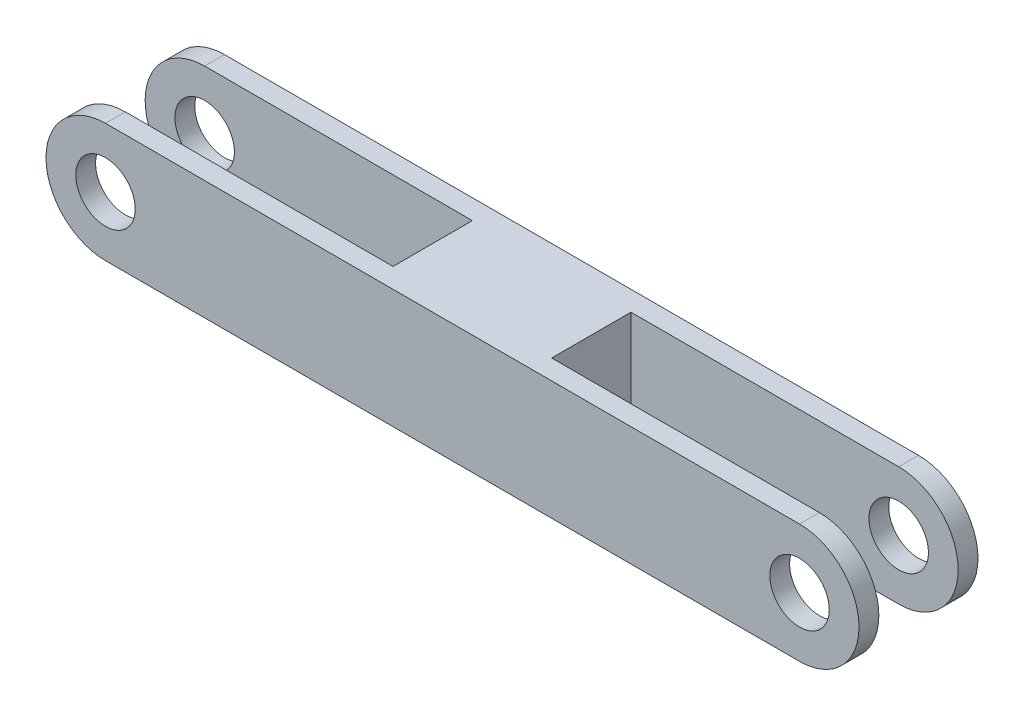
from build123d import *

# Parameters (mm, degrees)
SKETCH1_R          = 1.5
EXTRUDE1_DEPTH     = 3
CUT_EXTRUDE1_REACH = 40.588
SKETCH2_W          = 16.5
SKETCH2_H          = 4


with BuildPart() as part:
    # Sketch1 → Extrude1 (new, symmetric)
    with BuildSketch(Plane.XY):
        with BuildLine():
            Line((0, -3), (35, -3))
            ThreePointArc((35, -3), (38, 0), (35, 3))
            Line((35, 3), (0, 3))
            ThreePointArc((0, 3), (-3, 0), (0, -3))
        make_face()
        Circle(SKETCH1_R, mode=Mode.SUBTRACT)
        with Locations((35, 0)):
            Circle(SKETCH1_R, mode=Mode.SUBTRACT)
    extrude(amount=EXTRUDE1_DEPTH, both=True)

    # Sketch2 → Cut-Extrude1 (cut, up to next)
    with BuildSketch(Plane(origin=(0, 3, 0), x_dir=(-1, 0, 0), z_dir=(0, 1, 0)), mode=Mode.PRIVATE) as cut_extrude1_sk1:
        with Locations((-29.75, 0)):
            Rectangle(SKETCH2_W, SKETCH2_H)
    cut_extrude1_tool1 = extrude(cut_extrude1_sk1.sketch, amount=-CUT_EXTRUDE1_REACH, mode=Mode.PRIVATE) & part.part
    # Sketch2 → Cut-Extrude1 (cut, up to next)
    with BuildSketch(Plane(origin=(0, 3, 0), x_dir=(-1, 0, 0), z_dir=(0, 1, 0)), mode=Mode.PRIVATE) as cut_extrude1_sk2:
        with Locations((-5.25, 0)):
            Rectangle(SKETCH2_W, SKETCH2_H)
    cut_extrude1_tool2 = extrude(cut_extrude1_sk2.sketch, amount=-CUT_EXTRUDE1_REACH, mode=Mode.PRIVATE) & part.part
    add(cut_extrude1_tool1.solids().sort_by_distance((29.75, 3, 0))[0], mode=Mode.SUBTRACT)
    add(cut_extrude1_tool2.solids().sort_by_distance((5.25, 3, 0))[0], mode=Mode.SUBTRACT)


solid = part.part
